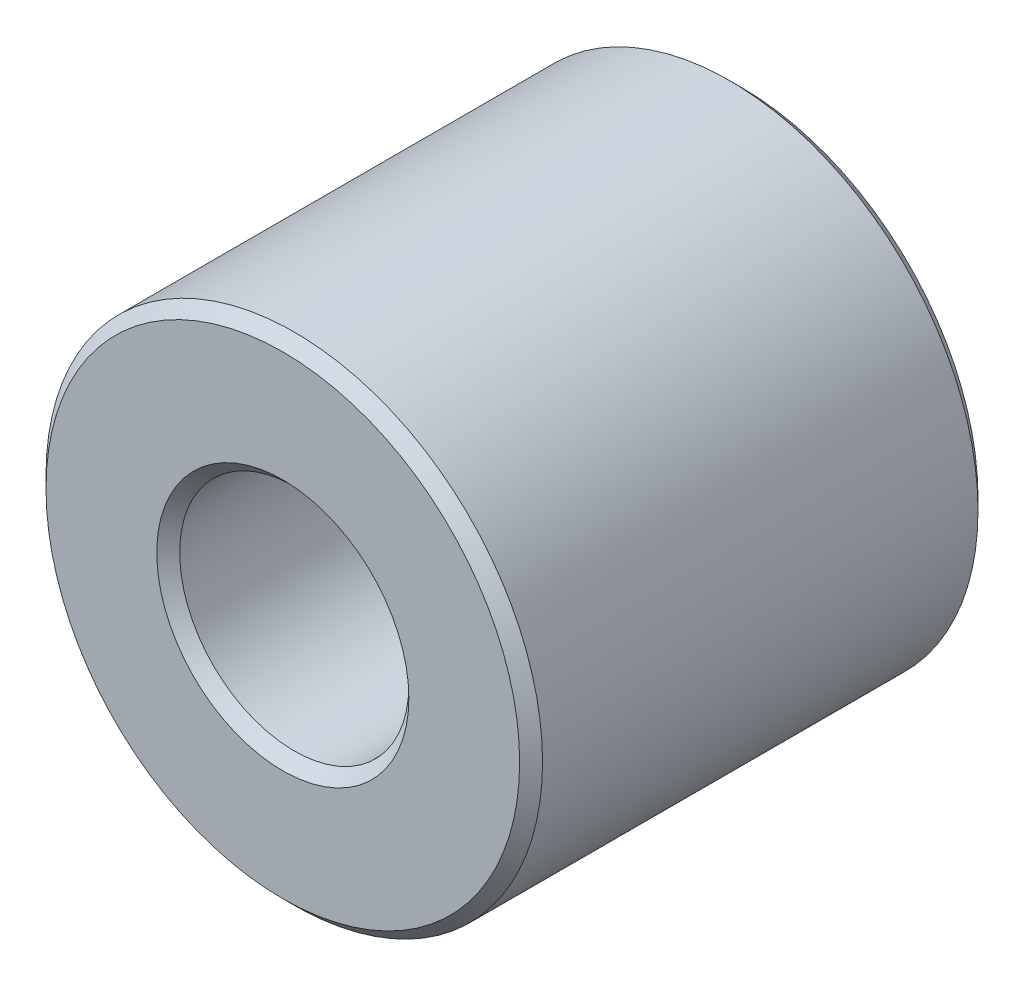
ISO-10303-21;
HEADER;
FILE_DESCRIPTION(('STEP AP214'),'2;1');
FILE_NAME('part.step','',(''),(''),'','','');
FILE_SCHEMA(('AUTOMOTIVE_DESIGN { 1 0 10303 214 1 1 1 1 }'));
ENDSEC;
DATA;
#1=APPLICATION_CONTEXT('core data for automotive mechanical design processes');
#2=APPLICATION_PROTOCOL_DEFINITION('international standard','automotive_design',2000,#1);
#3=PRODUCT_CONTEXT('',#1,'mechanical');
#4=PRODUCT('Part','Part','',(#3));
#5=PRODUCT_RELATED_PRODUCT_CATEGORY('part','',(#4));
#6=PRODUCT_DEFINITION_FORMATION('','',#4);
#7=PRODUCT_DEFINITION_CONTEXT('part definition',#1,'design');
#8=PRODUCT_DEFINITION('design','',#6,#7);
#9=PRODUCT_DEFINITION_SHAPE('','',#8);
#10=(LENGTH_UNIT() NAMED_UNIT(*) SI_UNIT(.MILLI.,.METRE.));
#11=(NAMED_UNIT(*) PLANE_ANGLE_UNIT() SI_UNIT($,.RADIAN.));
#12=(NAMED_UNIT(*) SI_UNIT($,.STERADIAN.) SOLID_ANGLE_UNIT());
#13=UNCERTAINTY_MEASURE_WITH_UNIT(LENGTH_MEASURE(1.E-05),#10,'distance_accuracy_value','');
#14=(GEOMETRIC_REPRESENTATION_CONTEXT(3) GLOBAL_UNCERTAINTY_ASSIGNED_CONTEXT((#13)) GLOBAL_UNIT_ASSIGNED_CONTEXT((#10,
#11,#12)) REPRESENTATION_CONTEXT('',''));
#15=CARTESIAN_POINT('',(0.,0.,0.));
#16=DIRECTION('',(0.,0.,1.));
#17=DIRECTION('',(1.,0.,0.));
#18=AXIS2_PLACEMENT_3D('',#15,#16,#17);
#19=CARTESIAN_POINT('',(0.,0.,12.));
#20=DIRECTION('',(0.,0.,1.));
#21=DIRECTION('',(1.,0.,0.));
#22=AXIS2_PLACEMENT_3D('',#19,#20,#21);
#23=PLANE('',#22);
#24=CARTESIAN_POINT('',(0.,0.,12.));
#25=DIRECTION('',(0.,0.,1.));
#26=DIRECTION('',(1.,0.,0.));
#27=AXIS2_PLACEMENT_3D('',#24,#25,#26);
#28=CIRCLE('',#27,6.6);
#29=CARTESIAN_POINT('',(6.6,0.,12.));
#30=VERTEX_POINT('',#29);
#31=EDGE_CURVE('E10',#30,#30,#28,.F.);
#32=ORIENTED_EDGE('',*,*,#31,.T.);
#33=EDGE_LOOP('',(#32));
#34=FACE_BOUND('',#33,.T.);
#35=CARTESIAN_POINT('',(0.,0.,12.));
#36=DIRECTION('',(0.,0.,1.));
#37=DIRECTION('',(1.,0.,0.));
#38=AXIS2_PLACEMENT_3D('',#35,#36,#37);
#39=CIRCLE('',#38,12.4);
#40=CARTESIAN_POINT('',(12.4,0.,12.));
#41=VERTEX_POINT('',#40);
#42=EDGE_CURVE('E40',#41,#41,#39,.T.);
#43=ORIENTED_EDGE('',*,*,#42,.T.);
#44=EDGE_LOOP('',(#43));
#45=FACE_BOUND('',#44,.T.);
#46=ADVANCED_FACE('F33',(#34,#45),#23,.T.);
#47=CARTESIAN_POINT('',(0.,0.,-12.));
#48=DIRECTION('',(0.,0.,1.));
#49=DIRECTION('',(1.,0.,0.));
#50=AXIS2_PLACEMENT_3D('',#47,#48,#49);
#51=PLANE('',#50);
#52=CARTESIAN_POINT('',(0.,0.,-12.));
#53=DIRECTION('',(0.,0.,1.));
#54=DIRECTION('',(1.,0.,0.));
#55=AXIS2_PLACEMENT_3D('',#52,#53,#54);
#56=CIRCLE('',#55,6.6);
#57=CARTESIAN_POINT('',(6.6,0.,-12.));
#58=VERTEX_POINT('',#57);
#59=EDGE_CURVE('E59',#58,#58,#56,.T.);
#60=ORIENTED_EDGE('',*,*,#59,.T.);
#61=EDGE_LOOP('',(#60));
#62=FACE_BOUND('',#61,.T.);
#63=CARTESIAN_POINT('',(0.,0.,-12.));
#64=DIRECTION('',(0.,0.,1.));
#65=DIRECTION('',(1.,0.,0.));
#66=AXIS2_PLACEMENT_3D('',#63,#64,#65);
#67=CIRCLE('',#66,12.4);
#68=CARTESIAN_POINT('',(12.4,0.,-12.));
#69=VERTEX_POINT('',#68);
#70=EDGE_CURVE('E62',#69,#69,#67,.F.);
#71=ORIENTED_EDGE('',*,*,#70,.T.);
#72=EDGE_LOOP('',(#71));
#73=FACE_BOUND('',#72,.T.);
#74=ADVANCED_FACE('F66',(#62,#73),#51,.F.);
#75=CARTESIAN_POINT('',(0.,0.,12.));
#76=DIRECTION('',(0.,0.,-1.));
#77=DIRECTION('',(-1.,0.,0.));
#78=AXIS2_PLACEMENT_3D('',#75,#76,#77);
#79=CYLINDRICAL_SURFACE('',#78,13.);
#80=CARTESIAN_POINT('',(0.,0.,-11.4));
#81=DIRECTION('',(0.,0.,1.));
#82=DIRECTION('',(1.,0.,0.));
#83=AXIS2_PLACEMENT_3D('',#80,#81,#82);
#84=CIRCLE('',#83,13.);
#85=CARTESIAN_POINT('',(13.,0.,-11.4));
#86=VERTEX_POINT('',#85);
#87=EDGE_CURVE('E44',#86,#86,#84,.T.);
#88=ORIENTED_EDGE('',*,*,#87,.T.);
#89=EDGE_LOOP('',(#88));
#90=FACE_BOUND('',#89,.T.);
#91=CARTESIAN_POINT('',(0.,0.,11.4));
#92=DIRECTION('',(0.,0.,1.));
#93=DIRECTION('',(1.,0.,0.));
#94=AXIS2_PLACEMENT_3D('',#91,#92,#93);
#95=CIRCLE('',#94,13.);
#96=CARTESIAN_POINT('',(13.,0.,11.4));
#97=VERTEX_POINT('',#96);
#98=EDGE_CURVE('E48',#97,#97,#95,.F.);
#99=ORIENTED_EDGE('',*,*,#98,.T.);
#100=EDGE_LOOP('',(#99));
#101=FACE_BOUND('',#100,.T.);
#102=ADVANCED_FACE('F76',(#90,#101),#79,.T.);
#103=CARTESIAN_POINT('',(0.,0.,12.));
#104=DIRECTION('',(0.,0.,-1.));
#105=DIRECTION('',(-1.,0.,0.));
#106=AXIS2_PLACEMENT_3D('',#103,#104,#105);
#107=CYLINDRICAL_SURFACE('',#106,6.);
#108=CARTESIAN_POINT('',(0.,0.,-11.4));
#109=DIRECTION('',(0.,0.,1.));
#110=DIRECTION('',(1.,0.,0.));
#111=AXIS2_PLACEMENT_3D('',#108,#109,#110);
#112=CIRCLE('',#111,6.);
#113=CARTESIAN_POINT('',(6.,0.,-11.4));
#114=VERTEX_POINT('',#113);
#115=EDGE_CURVE('E53',#114,#114,#112,.F.);
#116=ORIENTED_EDGE('',*,*,#115,.T.);
#117=EDGE_LOOP('',(#116));
#118=FACE_BOUND('',#117,.T.);
#119=CARTESIAN_POINT('',(0.,0.,11.4));
#120=DIRECTION('',(0.,0.,1.));
#121=DIRECTION('',(1.,0.,0.));
#122=AXIS2_PLACEMENT_3D('',#119,#120,#121);
#123=CIRCLE('',#122,6.);
#124=CARTESIAN_POINT('',(6.,0.,11.4));
#125=VERTEX_POINT('',#124);
#126=EDGE_CURVE('E56',#125,#125,#123,.T.);
#127=ORIENTED_EDGE('',*,*,#126,.T.);
#128=EDGE_LOOP('',(#127));
#129=FACE_BOUND('',#128,.T.);
#130=ADVANCED_FACE('F79',(#118,#129),#107,.F.);
#131=CARTESIAN_POINT('',(0.,0.,-12.));
#132=DIRECTION('',(0.,0.,-1.));
#133=DIRECTION('',(-1.,0.,0.));
#134=AXIS2_PLACEMENT_3D('',#131,#132,#133);
#135=CONICAL_SURFACE('',#134,6.6,0.785398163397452);
#136=ORIENTED_EDGE('',*,*,#115,.F.);
#137=EDGE_LOOP('',(#136));
#138=FACE_BOUND('',#137,.T.);
#139=ORIENTED_EDGE('',*,*,#59,.F.);
#140=EDGE_LOOP('',(#139));
#141=FACE_BOUND('',#140,.T.);
#142=ADVANCED_FACE('F72',(#138,#141),#135,.F.);
#143=CARTESIAN_POINT('',(0.,0.,-11.4));
#144=DIRECTION('',(0.,0.,1.));
#145=DIRECTION('',(1.,0.,0.));
#146=AXIS2_PLACEMENT_3D('',#143,#144,#145);
#147=CONICAL_SURFACE('',#146,13.,0.785398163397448);
#148=ORIENTED_EDGE('',*,*,#70,.F.);
#149=EDGE_LOOP('',(#148));
#150=FACE_BOUND('',#149,.T.);
#151=ORIENTED_EDGE('',*,*,#87,.F.);
#152=EDGE_LOOP('',(#151));
#153=FACE_BOUND('',#152,.T.);
#154=ADVANCED_FACE('F68',(#150,#153),#147,.T.);
#155=CARTESIAN_POINT('',(0.,0.,11.4));
#156=DIRECTION('',(0.,0.,1.));
#157=DIRECTION('',(1.,0.,0.));
#158=AXIS2_PLACEMENT_3D('',#155,#156,#157);
#159=CONICAL_SURFACE('',#158,6.,0.785398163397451);
#160=ORIENTED_EDGE('',*,*,#31,.F.);
#161=EDGE_LOOP('',(#160));
#162=FACE_BOUND('',#161,.T.);
#163=ORIENTED_EDGE('',*,*,#126,.F.);
#164=EDGE_LOOP('',(#163));
#165=FACE_BOUND('',#164,.T.);
#166=ADVANCED_FACE('F71',(#162,#165),#159,.F.);
#167=CARTESIAN_POINT('',(0.,0.,12.));
#168=DIRECTION('',(0.,0.,-1.));
#169=DIRECTION('',(-1.,0.,0.));
#170=AXIS2_PLACEMENT_3D('',#167,#168,#169);
#171=CONICAL_SURFACE('',#170,12.4,0.785398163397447);
#172=ORIENTED_EDGE('',*,*,#98,.F.);
#173=EDGE_LOOP('',(#172));
#174=FACE_BOUND('',#173,.T.);
#175=ORIENTED_EDGE('',*,*,#42,.F.);
#176=EDGE_LOOP('',(#175));
#177=FACE_BOUND('',#176,.T.);
#178=ADVANCED_FACE('F35',(#174,#177),#171,.T.);
#179=CLOSED_SHELL('',(#46,#74,#102,#130,#142,#154,#166,#178));
#180=MANIFOLD_SOLID_BREP('B2',#179);
#181=ADVANCED_BREP_SHAPE_REPRESENTATION('',(#18,#180),#14);
#182=SHAPE_DEFINITION_REPRESENTATION(#9,#181);
ENDSEC;
END-ISO-10303-21;
